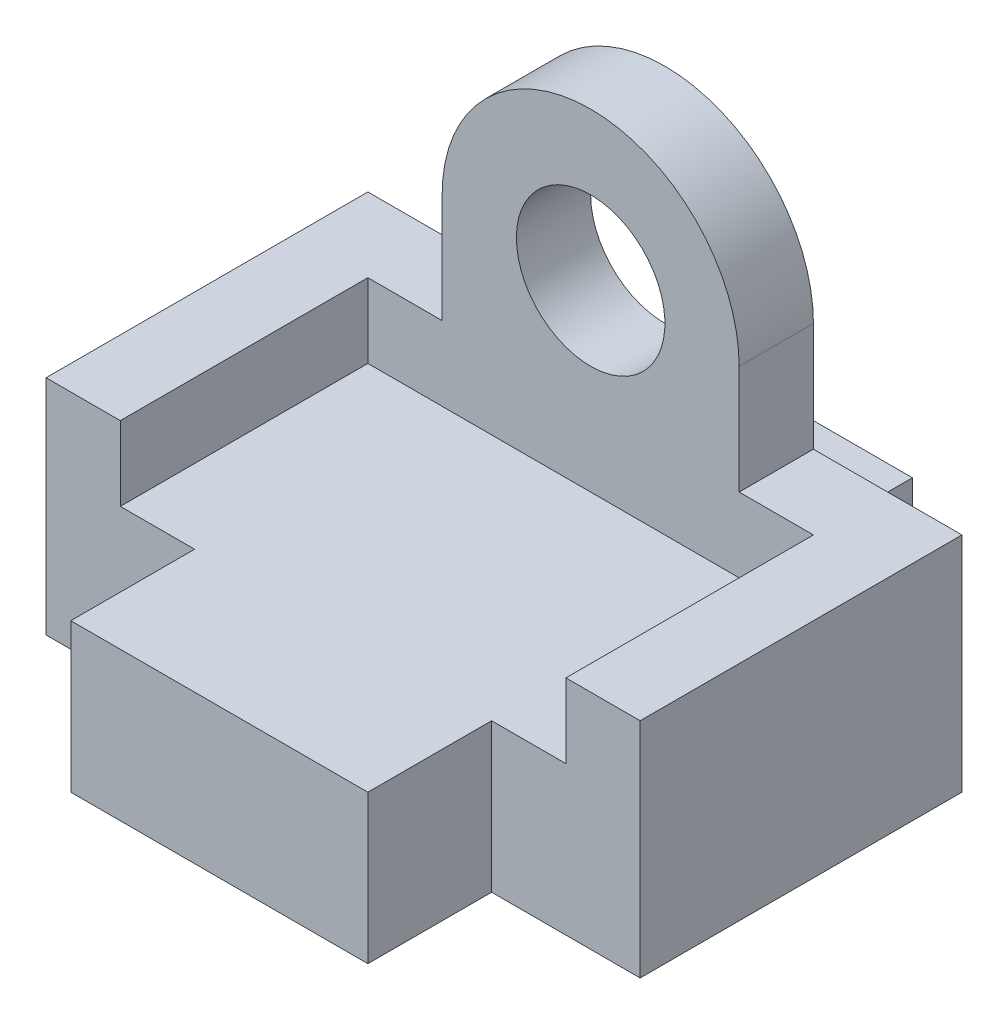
from build123d import *

# Parameters (mm, degrees)
SKETCH_1_W      = 90
SKETCH_1_H      = 50
EXTRUDE_1_DEPTH = 30
EXTRUDE_2_DEPTH = 45
SKETCH_2_W      = 60
SKETCH_2_H      = 30
EXTRUDE_3_DEPTH = 25
SKETCH_3_R      = 15
EXTRUDE_4_DEPTH = 15
SKETCH_2_2_W    = 60
SKETCH_2_2_H    = 30
EXTRUDE_5_DEPTH = 85


with BuildPart() as part:
    # Sketch 1 → Extrude 1 (new body)
    with BuildSketch(Plane(origin=(0, 0, 0), x_dir=(1, 0, 0), z_dir=(0, 1, 0))):
        with Locations((0, -40)):
            Rectangle(SKETCH_1_W, SKETCH_1_H)
    extrude(amount=EXTRUDE_1_DEPTH)

    # Sketch 1_3 → Extrude 2 (add)
    with BuildSketch(Plane(origin=(0, 0, 0), x_dir=(1, 0, 0), z_dir=(0, 1, 0))):
        Polygon((60, 0), (-60, 0), (-60, -65), (-45, -65), (-45, -15), (45, -15), (45, -65), (60, -65), align=None)
    extrude(amount=EXTRUDE_2_DEPTH)

    # Sketch 2 → Extrude 3 (add)
    with BuildSketch(Plane.XY.offset(65)):
        with Locations((0, 15)):
            Rectangle(SKETCH_2_W, SKETCH_2_H)
    extrude(amount=EXTRUDE_3_DEPTH)

    # Sketch 3 → Extrude 4 (add)
    with BuildSketch(Plane(origin=(0, 0, 0), x_dir=(-1, 0, 0), z_dir=(0, 0, -1))):
        with BuildLine():
            Line((-30, 45), (-30, 67))
            ThreePointArc((-30, 67), (0, 97), (30, 67))
            Line((30, 67), (30, 45))
            Line((30, 45), (-30, 45))
        make_face()
        with Locations((0, 67)):
            Circle(SKETCH_3_R, mode=Mode.SUBTRACT)
    extrude(amount=-EXTRUDE_4_DEPTH)

    # Sketch 2_2 → Extrude 5 (add)
    with BuildSketch(Plane.XY.offset(65)):
        with Locations((0, 15)):
            Rectangle(SKETCH_2_2_W, SKETCH_2_2_H)
    extrude(amount=-EXTRUDE_5_DEPTH)


solid = part.part
